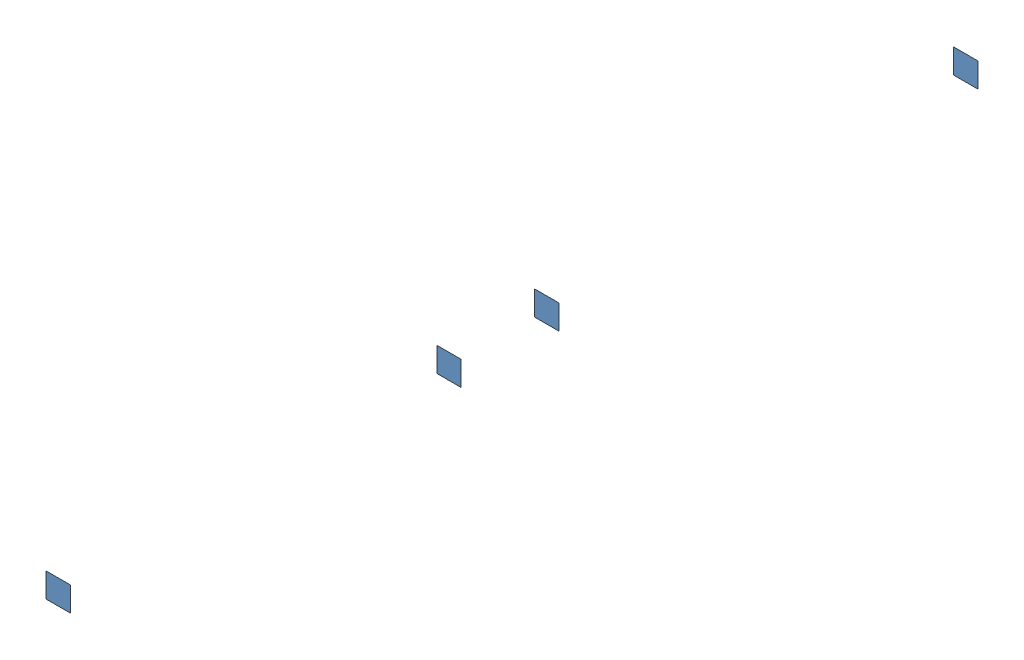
SolidWorks assembly Baugruppe3.SLDASM, configuration Standard (file format 3400). Lengths in mm.
Overall size (50 50 1858.01).
6 component instances, 1 part files, 4 mates.
Components (placement in the parent):
- Baugruppe2-1: Baugruppe2.SLDASM [Standard-_flexible1] at origin size (50 50 1858.01) (flexible)
  - FLAECHE-1: FLAECHE.SLDPRT [Standard] at (0 0 -1858.0118) size (50 50 0)
  - Baugruppe1-1: Baugruppe1.SLDASM [Standard-_flexible2] at origin size (50 50 1000) (flexible)
    - FLAECHE-1: FLAECHE.SLDPRT [Standard] at origin size (50 50 0)
    - FLAECHE-2: FLAECHE.SLDPRT [Standard] at (0 0 -800) size (50 50 0)
    - FLAECHE-3: FLAECHE.SLDPRT [Standard] at (0 0 -1000) size (50 50 0)
Mates (geometry in assembly coordinates):
- Deckungsgleich4: coincident aligned: plane of ?; plane of assembly
- Deckungsgleich5: coincident aligned: plane of ?; plane of assembly
- Deckungsgleich6: coincident aligned: unknown of Baugruppe2-1/Baugruppe1-1/FLAECHE-1
- LimitAbstand2: limit distance = 1858.0118 mm: unknown of Baugruppe2-1/FLAECHE-1
